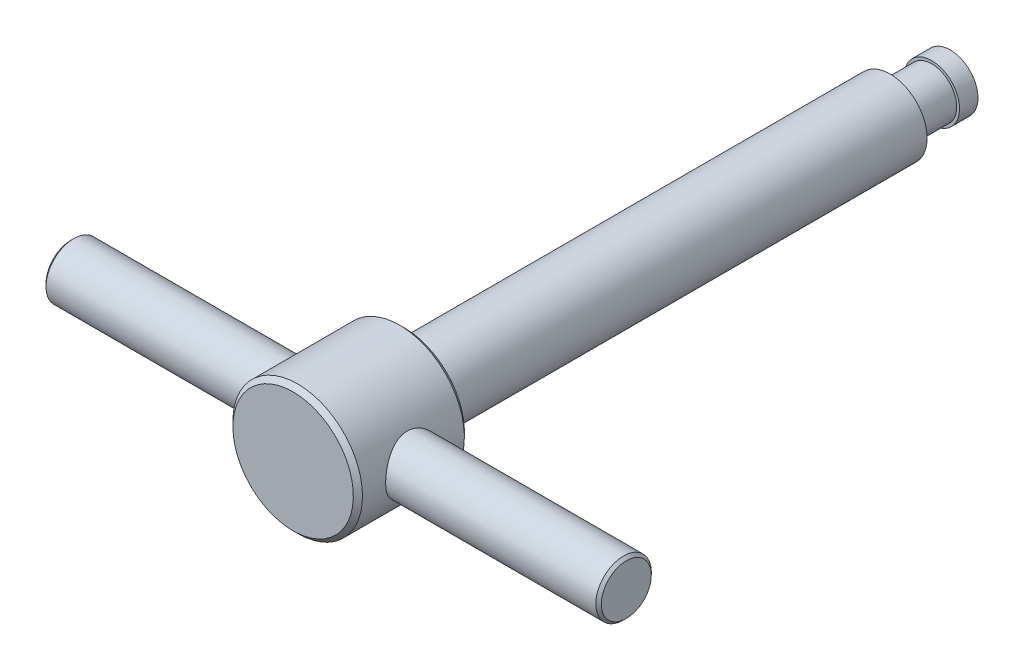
ISO-10303-21;
HEADER;
FILE_DESCRIPTION(('STEP AP214'),'2;1');
FILE_NAME('part.step','',(''),(''),'','','');
FILE_SCHEMA(('AUTOMOTIVE_DESIGN { 1 0 10303 214 1 1 1 1 }'));
ENDSEC;
DATA;
#1=APPLICATION_CONTEXT('core data for automotive mechanical design processes');
#2=APPLICATION_PROTOCOL_DEFINITION('international standard','automotive_design',2000,#1);
#3=PRODUCT_CONTEXT('',#1,'mechanical');
#4=PRODUCT('Part','Part','',(#3));
#5=PRODUCT_RELATED_PRODUCT_CATEGORY('part','',(#4));
#6=PRODUCT_DEFINITION_FORMATION('','',#4);
#7=PRODUCT_DEFINITION_CONTEXT('part definition',#1,'design');
#8=PRODUCT_DEFINITION('design','',#6,#7);
#9=PRODUCT_DEFINITION_SHAPE('','',#8);
#10=(LENGTH_UNIT() NAMED_UNIT(*) SI_UNIT(.MILLI.,.METRE.));
#11=(NAMED_UNIT(*) PLANE_ANGLE_UNIT() SI_UNIT($,.RADIAN.));
#12=(NAMED_UNIT(*) SI_UNIT($,.STERADIAN.) SOLID_ANGLE_UNIT());
#13=UNCERTAINTY_MEASURE_WITH_UNIT(LENGTH_MEASURE(1.E-05),#10,'distance_accuracy_value','');
#14=(GEOMETRIC_REPRESENTATION_CONTEXT(3) GLOBAL_UNCERTAINTY_ASSIGNED_CONTEXT((#13)) GLOBAL_UNIT_ASSIGNED_CONTEXT((#10,
#11,#12)) REPRESENTATION_CONTEXT('',''));
#15=CARTESIAN_POINT('',(0.,0.,0.));
#16=DIRECTION('',(0.,0.,1.));
#17=DIRECTION('',(1.,0.,0.));
#18=AXIS2_PLACEMENT_3D('',#15,#16,#17);
#19=CARTESIAN_POINT('',(30.,0.,68.7));
#20=DIRECTION('',(-1.,0.,0.));
#21=DIRECTION('',(0.,-1.,0.));
#22=AXIS2_PLACEMENT_3D('',#19,#20,#21);
#23=PLANE('',#22);
#24=CARTESIAN_POINT('',(29.9999999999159,0.,66.));
#25=DIRECTION('',(-1.,0.,0.));
#26=DIRECTION('',(0.,-1.,0.));
#27=AXIS2_PLACEMENT_3D('',#24,#25,#26);
#28=CIRCLE('',#27,2.70000000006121);
#29=CARTESIAN_POINT('',(29.9999999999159,-2.70000000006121,66.));
#30=VERTEX_POINT('',#29);
#31=EDGE_CURVE('E15',#30,#30,#28,.T.);
#32=ORIENTED_EDGE('',*,*,#31,.F.);
#33=EDGE_LOOP('',(#32));
#34=FACE_BOUND('',#33,.T.);
#35=ADVANCED_FACE('F12',(#34),#23,.F.);
#36=CARTESIAN_POINT('',(-30.,0.,66.));
#37=DIRECTION('',(1.,0.,0.));
#38=DIRECTION('',(0.,1.,0.));
#39=AXIS2_PLACEMENT_3D('',#36,#37,#38);
#40=PLANE('',#39);
#41=CARTESIAN_POINT('',(-29.9999999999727,0.,66.));
#42=DIRECTION('',(1.,0.,0.));
#43=DIRECTION('',(0.,1.,0.));
#44=AXIS2_PLACEMENT_3D('',#41,#42,#43);
#45=CIRCLE('',#44,2.70000000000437);
#46=CARTESIAN_POINT('',(-29.9999999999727,2.70000000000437,66.));
#47=VERTEX_POINT('',#46);
#48=EDGE_CURVE('E133',#47,#47,#45,.T.);
#49=ORIENTED_EDGE('',*,*,#48,.F.);
#50=EDGE_LOOP('',(#49));
#51=FACE_BOUND('',#50,.T.);
#52=ADVANCED_FACE('F171',(#51),#40,.F.);
#53=CARTESIAN_POINT('',(0.,0.,5.));
#54=DIRECTION('',(-1.,0.,0.));
#55=DIRECTION('',(0.,1.,0.));
#56=AXIS2_PLACEMENT_3D('',#53,#54,#55);
#57=SPHERICAL_SURFACE('',#56,5.);
#58=CARTESIAN_POINT('',(0.,0.,1.));
#59=DIRECTION('',(0.,0.,1.));
#60=DIRECTION('',(0.,-1.,0.));
#61=AXIS2_PLACEMENT_3D('',#58,#59,#60);
#62=CIRCLE('',#61,3.);
#63=CARTESIAN_POINT('',(0.,-3.,1.));
#64=VERTEX_POINT('',#63);
#65=EDGE_CURVE('E126',#64,#64,#62,.T.);
#66=ORIENTED_EDGE('',*,*,#65,.F.);
#67=EDGE_LOOP('',(#66));
#68=FACE_BOUND('',#67,.T.);
#69=ADVANCED_FACE('F168',(#68),#57,.T.);
#70=CARTESIAN_POINT('',(29.700000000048,0.,66.));
#71=DIRECTION('',(-1.,0.,0.));
#72=DIRECTION('',(0.,-1.,0.));
#73=AXIS2_PLACEMENT_3D('',#70,#71,#72);
#74=CONICAL_SURFACE('',#73,2.99999999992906,0.785398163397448);
#75=CARTESIAN_POINT('',(29.7,0.,66.));
#76=DIRECTION('',(-1.,0.,0.));
#77=DIRECTION('',(0.,-1.,0.));
#78=AXIS2_PLACEMENT_3D('',#75,#76,#77);
#79=CIRCLE('',#78,3.);
#80=CARTESIAN_POINT('',(29.7,-3.,66.));
#81=VERTEX_POINT('',#80);
#82=EDGE_CURVE('E124',#81,#81,#79,.T.);
#83=ORIENTED_EDGE('',*,*,#82,.F.);
#84=EDGE_LOOP('',(#83));
#85=FACE_BOUND('',#84,.T.);
#86=ORIENTED_EDGE('',*,*,#31,.T.);
#87=EDGE_LOOP('',(#86));
#88=FACE_BOUND('',#87,.T.);
#89=ADVANCED_FACE('F164',(#85,#88),#74,.T.);
#90=CARTESIAN_POINT('',(0.,0.,72.));
#91=DIRECTION('',(0.,0.,-1.));
#92=DIRECTION('',(0.,1.,0.));
#93=AXIS2_PLACEMENT_3D('',#90,#91,#92);
#94=PLANE('',#93);
#95=CARTESIAN_POINT('',(0.,0.,71.9999999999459));
#96=DIRECTION('',(0.,0.,-1.));
#97=DIRECTION('',(0.,1.,0.));
#98=AXIS2_PLACEMENT_3D('',#95,#96,#97);
#99=CIRCLE('',#98,6.50502525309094);
#100=CARTESIAN_POINT('',(0.,6.50502525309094,71.9999999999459));
#101=VERTEX_POINT('',#100);
#102=EDGE_CURVE('E121',#101,#101,#99,.T.);
#103=ORIENTED_EDGE('',*,*,#102,.F.);
#104=EDGE_LOOP('',(#103));
#105=FACE_BOUND('',#104,.T.);
#106=ADVANCED_FACE('F160',(#105),#94,.F.);
#107=CARTESIAN_POINT('',(-29.6999999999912,0.,66.));
#108=DIRECTION('',(1.,0.,0.));
#109=DIRECTION('',(0.,1.,0.));
#110=AXIS2_PLACEMENT_3D('',#107,#108,#109);
#111=CONICAL_SURFACE('',#110,2.99999999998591,0.785398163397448);
#112=ORIENTED_EDGE('',*,*,#48,.T.);
#113=EDGE_LOOP('',(#112));
#114=FACE_BOUND('',#113,.T.);
#115=CARTESIAN_POINT('',(-29.7,0.,66.));
#116=DIRECTION('',(-1.,0.,0.));
#117=DIRECTION('',(0.,-1.,0.));
#118=AXIS2_PLACEMENT_3D('',#115,#116,#117);
#119=CIRCLE('',#118,3.);
#120=CARTESIAN_POINT('',(-29.7,-3.,66.));
#121=VERTEX_POINT('',#120);
#122=EDGE_CURVE('E117',#121,#121,#119,.F.);
#123=ORIENTED_EDGE('',*,*,#122,.F.);
#124=EDGE_LOOP('',(#123));
#125=FACE_BOUND('',#124,.T.);
#126=ADVANCED_FACE('F154',(#114,#125),#111,.T.);
#127=CARTESIAN_POINT('',(0.,0.,0.));
#128=DIRECTION('',(0.,0.,1.));
#129=DIRECTION('',(0.,-1.,0.));
#130=AXIS2_PLACEMENT_3D('',#127,#128,#129);
#131=CYLINDRICAL_SURFACE('',#130,3.);
#132=CARTESIAN_POINT('',(0.,0.,3.));
#133=DIRECTION('',(0.,0.,1.));
#134=DIRECTION('',(0.,-1.,0.));
#135=AXIS2_PLACEMENT_3D('',#132,#133,#134);
#136=CIRCLE('',#135,3.);
#137=CARTESIAN_POINT('',(0.,-3.,3.));
#138=VERTEX_POINT('',#137);
#139=EDGE_CURVE('E120',#138,#138,#136,.F.);
#140=ORIENTED_EDGE('',*,*,#139,.T.);
#141=EDGE_LOOP('',(#140));
#142=FACE_BOUND('',#141,.T.);
#143=ORIENTED_EDGE('',*,*,#65,.T.);
#144=EDGE_LOOP('',(#143));
#145=FACE_BOUND('',#144,.T.);
#146=ADVANCED_FACE('F147',(#142,#145),#131,.T.);
#147=CARTESIAN_POINT('',(30.,0.,66.));
#148=DIRECTION('',(-1.,0.,0.));
#149=DIRECTION('',(0.,-1.,0.));
#150=AXIS2_PLACEMENT_3D('',#147,#148,#149);
#151=CYLINDRICAL_SURFACE('',#150,3.);
#152=CARTESIAN_POINT('',(6.32634555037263,2.99622295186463,65.8495073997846));
#153=CARTESIAN_POINT('',(6.32826447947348,2.99217213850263,65.7688757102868));
#154=CARTESIAN_POINT('',(6.33172535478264,2.98486151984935,65.6884118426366));
#155=CARTESIAN_POINT('',(6.34160222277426,2.96381632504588,65.5284968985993));
#156=CARTESIAN_POINT('',(6.34802020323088,2.95007742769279,65.4490465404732));
#157=CARTESIAN_POINT('',(6.3714403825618,2.89934380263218,65.2127740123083));
#158=CARTESIAN_POINT('',(6.39260177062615,2.85284537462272,65.0582841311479));
#159=CARTESIAN_POINT('',(6.44315888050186,2.73672071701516,64.7607182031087));
#160=CARTESIAN_POINT('',(6.47251695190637,2.66719997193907,64.6175937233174));
#161=CARTESIAN_POINT('',(6.53618130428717,2.50713763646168,64.3449352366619));
#162=CARTESIAN_POINT('',(6.57048627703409,2.41660159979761,64.2153976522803));
#163=CARTESIAN_POINT('',(6.64282052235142,2.21033740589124,63.964715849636));
#164=CARTESIAN_POINT('',(6.68094850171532,2.09338697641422,63.844604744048));
#165=CARTESIAN_POINT('',(6.75493795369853,1.84068917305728,63.6251585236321));
#166=CARTESIAN_POINT('',(6.79079872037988,1.70493598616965,63.5258298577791));
#167=CARTESIAN_POINT('',(6.85745262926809,1.41359734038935,63.3482779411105));
#168=CARTESIAN_POINT('',(6.88807643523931,1.25756417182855,63.270720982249));
#169=CARTESIAN_POINT('',(6.93948106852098,0.933018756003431,63.1434624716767));
#170=CARTESIAN_POINT('',(6.96026753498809,0.764513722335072,63.0937449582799));
#171=CARTESIAN_POINT('',(6.98854168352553,0.431666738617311,63.0266901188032));
#172=CARTESIAN_POINT('',(6.99681179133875,0.267775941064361,63.0074438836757));
#173=CARTESIAN_POINT('',(7.001662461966,-0.061091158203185,62.996117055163));
#174=CARTESIAN_POINT('',(6.9982467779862,-0.226067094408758,63.0040277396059));
#175=CARTESIAN_POINT('',(6.98061410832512,-0.543036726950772,63.0454634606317));
#176=CARTESIAN_POINT('',(6.966989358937,-0.695250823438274,63.0775846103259));
#177=CARTESIAN_POINT('',(6.93097400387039,-0.991940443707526,63.164517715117));
#178=CARTESIAN_POINT('',(6.90858231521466,-1.13641500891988,63.2193324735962));
#179=CARTESIAN_POINT('',(6.85631790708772,-1.41849030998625,63.3518112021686));
#180=CARTESIAN_POINT('',(6.8262389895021,-1.5557499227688,63.4301174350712));
#181=CARTESIAN_POINT('',(6.76175360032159,-1.81566779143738,63.6066635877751));
#182=CARTESIAN_POINT('',(6.72734530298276,-1.93831984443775,63.7049119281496));
#183=CARTESIAN_POINT('',(6.65467138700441,-2.17528088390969,63.9272021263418));
#184=CARTESIAN_POINT('',(6.61631054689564,-2.28826342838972,64.052630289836));
#185=CARTESIAN_POINT('',(6.54230506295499,-2.49199129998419,64.3211920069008));
#186=CARTESIAN_POINT('',(6.50666120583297,-2.58273020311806,64.4643306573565));
#187=CARTESIAN_POINT('',(6.44169002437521,-2.74082163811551,64.7680339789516));
#188=CARTESIAN_POINT('',(6.4124965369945,-2.80769373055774,64.9288795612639));
#189=CARTESIAN_POINT('',(6.36544592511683,-2.91281204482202,65.2611995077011));
#190=CARTESIAN_POINT('',(6.34757878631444,-2.95108355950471,65.4326643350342));
#191=CARTESIAN_POINT('',(6.32684241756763,-2.99526422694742,65.7666222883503));
#192=CARTESIAN_POINT('',(6.32289024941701,-3.00351193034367,65.9287396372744));
#193=CARTESIAN_POINT('',(6.32751135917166,-2.99376571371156,66.2519835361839));
#194=CARTESIAN_POINT('',(6.33608227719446,-2.97577673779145,66.4131102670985));
#195=CARTESIAN_POINT('',(6.36375836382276,-2.91608676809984,66.7209155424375));
#196=CARTESIAN_POINT('',(6.3822785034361,-2.87569894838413,66.8679066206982));
#197=CARTESIAN_POINT('',(6.42725603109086,-2.77371031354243,67.1530275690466));
#198=CARTESIAN_POINT('',(6.45371556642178,-2.71210375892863,67.2911550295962));
#199=CARTESIAN_POINT('',(6.51358659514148,-2.56512033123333,67.5638388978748));
#200=CARTESIAN_POINT('',(6.54732342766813,-2.47852390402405,67.6976650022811));
#201=CARTESIAN_POINT('',(6.61712783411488,-2.28563635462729,67.9496322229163));
#202=CARTESIAN_POINT('',(6.65319650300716,-2.17933593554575,68.0677658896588));
#203=CARTESIAN_POINT('',(6.72705004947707,-1.94001961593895,68.2946952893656));
#204=CARTESIAN_POINT('',(6.76474236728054,-1.80554916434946,68.4019947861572));
#205=CARTESIAN_POINT('',(6.83473227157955,-1.51925001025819,68.5925733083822));
#206=CARTESIAN_POINT('',(6.86703025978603,-1.36742260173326,68.6758541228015));
#207=CARTESIAN_POINT('',(6.9222349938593,-1.05252985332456,68.8144861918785));
#208=CARTESIAN_POINT('',(6.94526981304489,-0.88965696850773,68.870220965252));
#209=CARTESIAN_POINT('',(6.97992599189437,-0.555653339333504,68.9531009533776));
#210=CARTESIAN_POINT('',(6.99155445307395,-0.384527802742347,68.9802639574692));
#211=CARTESIAN_POINT('',(7.00161796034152,-0.0528390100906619,69.0037879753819));
#212=CARTESIAN_POINT('',(7.00098365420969,0.107545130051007,69.0023216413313));
#213=CARTESIAN_POINT('',(6.98886077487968,0.425608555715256,68.9739436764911));
#214=CARTESIAN_POINT('',(6.97737328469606,0.583288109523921,68.9470345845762));
#215=CARTESIAN_POINT('',(6.94513836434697,0.887657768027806,68.8698659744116));
#216=CARTESIAN_POINT('',(6.92462231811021,1.03452166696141,68.8201887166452));
#217=CARTESIAN_POINT('',(6.87632878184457,1.317870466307,68.6994354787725));
#218=CARTESIAN_POINT('',(6.84854960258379,1.45435294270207,68.6283545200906));
#219=CARTESIAN_POINT('',(6.78647151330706,1.72153399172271,68.4622072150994));
#220=CARTESIAN_POINT('',(6.75189125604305,1.85145959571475,68.3660047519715));
#221=CARTESIAN_POINT('',(6.68066929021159,2.09395764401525,68.1543583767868));
#222=CARTESIAN_POINT('',(6.64402670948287,2.20652267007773,68.0389062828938));
#223=CARTESIAN_POINT('',(6.56984841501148,2.41879434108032,67.7829464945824));
#224=CARTESIAN_POINT('',(6.53241556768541,2.51714659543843,67.6412826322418));
#225=CARTESIAN_POINT('',(6.46370144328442,2.68870997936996,67.341846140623));
#226=CARTESIAN_POINT('',(6.43242233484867,2.76191225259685,67.184067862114));
#227=CARTESIAN_POINT('',(6.39360961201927,2.85004205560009,66.9404988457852));
#228=CARTESIAN_POINT('',(6.38210422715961,2.87564429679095,66.8590623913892));
#229=CARTESIAN_POINT('',(6.36199032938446,2.91987586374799,66.6939817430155));
#230=CARTESIAN_POINT('',(6.35338035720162,2.9385087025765,66.6103386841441));
#231=CARTESIAN_POINT('',(6.33940677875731,2.9685341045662,66.4417284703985));
#232=CARTESIAN_POINT('',(6.33403480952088,2.97994532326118,66.3567653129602));
#233=CARTESIAN_POINT('',(6.32671830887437,2.99544842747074,66.1860694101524));
#234=CARTESIAN_POINT('',(6.32477116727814,2.99954588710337,66.1003373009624));
#235=CARTESIAN_POINT('',(6.32450831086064,3.00009880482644,65.9870854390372));
#236=CARTESIAN_POINT('',(6.32462478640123,2.99985362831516,65.9595527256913));
#237=CARTESIAN_POINT('',(6.32521628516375,2.99860624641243,65.9045093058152));
#238=CARTESIAN_POINT('',(6.32569129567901,2.99760406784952,65.8769985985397));
#239=CARTESIAN_POINT('',(6.32634555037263,2.99622295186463,65.8495073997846));
#240=B_SPLINE_CURVE_WITH_KNOTS('',3,(#152,#153,#154,#155,#156,#157,#158,#159,#160,#161,#162,
#163,#164,#165,#166,#167,#168,#169,#170,#171,#172,#173,#174,#175,#176,#177,#178,#179,#180,#181,
#182,#183,#184,#185,#186,#187,#188,#189,#190,#191,#192,#193,#194,#195,#196,#197,#198,#199,#200,
#201,#202,#203,#204,#205,#206,#207,#208,#209,#210,#211,#212,#213,#214,#215,#216,#217,#218,#219,
#220,#221,#222,#223,#224,#225,#226,#227,#228,#229,#230,#231,#232,#233,#234,#235,#236,#237,#238,
#239),.UNSPECIFIED.,.T.,.F.,(4,2,2,2,2,2,2,2,2,2,2,2,2,2,2,2,2,2,2,2,2,2,2,2,2,2,2,2,2,2,2,2,2,
2,2,2,2,2,2,2,2,2,2,4),(0.,0.242237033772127,0.484637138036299,0.970189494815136,
1.45354721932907,1.9367773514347,2.45025889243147,2.96389953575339,3.49187330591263,
4.0195440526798,4.51262569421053,5.00554898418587,5.47189828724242,5.93830521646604,
6.41885040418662,6.89959892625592,7.41659728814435,7.93374478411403,8.46078245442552,
8.98735348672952,9.47190919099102,9.95637359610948,10.4150497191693,10.8738500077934,
11.3606033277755,11.8475868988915,12.3734108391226,12.8991956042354,13.4174378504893,
13.9353572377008,14.4141361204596,14.8928672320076,15.3599854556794,15.8272124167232,
16.3210681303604,16.8151342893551,17.3420827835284,17.8692166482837,18.1273357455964,
18.3853245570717,18.6426441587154,18.899767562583,18.9823606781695,19.064950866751),.UNSPECIFIED.);
#241=CARTESIAN_POINT('',(6.32634555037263,2.99622295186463,65.8495073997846));
#242=VERTEX_POINT('',#241);
#243=EDGE_CURVE('E46',#242,#242,#240,.T.);
#244=ORIENTED_EDGE('',*,*,#243,.F.);
#245=EDGE_LOOP('',(#244));
#246=FACE_BOUND('',#245,.T.);
#247=ORIENTED_EDGE('',*,*,#82,.T.);
#248=EDGE_LOOP('',(#247));
#249=FACE_BOUND('',#248,.T.);
#250=ADVANCED_FACE('F145',(#246,#249),#151,.T.);
#251=CARTESIAN_POINT('',(0.,0.,71.5050252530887));
#252=DIRECTION('',(0.,0.,-1.));
#253=DIRECTION('',(0.,1.,0.));
#254=AXIS2_PLACEMENT_3D('',#251,#252,#253);
#255=CONICAL_SURFACE('',#254,6.99999999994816,0.785398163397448);
#256=ORIENTED_EDGE('',*,*,#102,.T.);
#257=EDGE_LOOP('',(#256));
#258=FACE_BOUND('',#257,.T.);
#259=CARTESIAN_POINT('',(0.,0.,71.5050252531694));
#260=DIRECTION('',(0.,0.,1.));
#261=DIRECTION('',(0.,-1.,0.));
#262=AXIS2_PLACEMENT_3D('',#259,#260,#261);
#263=CIRCLE('',#262,7.);
#264=CARTESIAN_POINT('',(0.,-7.,71.5050252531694));
#265=VERTEX_POINT('',#264);
#266=EDGE_CURVE('E45',#265,#265,#263,.F.);
#267=ORIENTED_EDGE('',*,*,#266,.F.);
#268=EDGE_LOOP('',(#267));
#269=FACE_BOUND('',#268,.T.);
#270=ADVANCED_FACE('F72',(#258,#269),#255,.T.);
#271=CARTESIAN_POINT('',(30.,0.,66.));
#272=DIRECTION('',(-1.,0.,0.));
#273=DIRECTION('',(0.,-1.,0.));
#274=AXIS2_PLACEMENT_3D('',#271,#272,#273);
#275=CYLINDRICAL_SURFACE('',#274,3.);
#276=ORIENTED_EDGE('',*,*,#122,.T.);
#277=EDGE_LOOP('',(#276));
#278=FACE_BOUND('',#277,.T.);
#279=CARTESIAN_POINT('',(-6.32634555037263,2.99622295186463,66.1504926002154));
#280=CARTESIAN_POINT('',(-6.32826447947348,2.99217213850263,66.2311242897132));
#281=CARTESIAN_POINT('',(-6.33172535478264,2.98486151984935,66.3115881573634));
#282=CARTESIAN_POINT('',(-6.34160222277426,2.96381632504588,66.4715031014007));
#283=CARTESIAN_POINT('',(-6.34802020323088,2.95007742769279,66.5509534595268));
#284=CARTESIAN_POINT('',(-6.3714403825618,2.89934380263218,66.7872259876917));
#285=CARTESIAN_POINT('',(-6.39260177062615,2.85284537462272,66.9417158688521));
#286=CARTESIAN_POINT('',(-6.44315888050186,2.73672071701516,67.2392817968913));
#287=CARTESIAN_POINT('',(-6.47251695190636,2.66719997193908,67.3824062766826));
#288=CARTESIAN_POINT('',(-6.53618130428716,2.5071376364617,67.6550647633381));
#289=CARTESIAN_POINT('',(-6.57048627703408,2.41660159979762,67.7846023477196));
#290=CARTESIAN_POINT('',(-6.64282052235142,2.21033740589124,68.035284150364));
#291=CARTESIAN_POINT('',(-6.68094850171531,2.09338697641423,68.155395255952));
#292=CARTESIAN_POINT('',(-6.75493795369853,1.84068917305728,68.3748414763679));
#293=CARTESIAN_POINT('',(-6.79079872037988,1.70493598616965,68.4741701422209));
#294=CARTESIAN_POINT('',(-6.85745262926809,1.41359734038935,68.6517220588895));
#295=CARTESIAN_POINT('',(-6.88807643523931,1.25756417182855,68.729279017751));
#296=CARTESIAN_POINT('',(-6.93948106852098,0.933018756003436,68.8565375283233));
#297=CARTESIAN_POINT('',(-6.96026753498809,0.764513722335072,68.9062550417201));
#298=CARTESIAN_POINT('',(-6.98854168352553,0.431666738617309,68.9733098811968));
#299=CARTESIAN_POINT('',(-6.99681179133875,0.26777594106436,68.9925561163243));
#300=CARTESIAN_POINT('',(-7.001662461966,-0.0610911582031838,69.003882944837));
#301=CARTESIAN_POINT('',(-6.9982467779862,-0.226067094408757,68.9959722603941));
#302=CARTESIAN_POINT('',(-6.98061410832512,-0.543036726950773,68.9545365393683));
#303=CARTESIAN_POINT('',(-6.966989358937,-0.695250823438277,68.9224153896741));
#304=CARTESIAN_POINT('',(-6.93097400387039,-0.991940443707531,68.8354822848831));
#305=CARTESIAN_POINT('',(-6.90858231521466,-1.13641500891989,68.7806675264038));
#306=CARTESIAN_POINT('',(-6.85631790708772,-1.41849030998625,68.6481887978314));
#307=CARTESIAN_POINT('',(-6.8262389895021,-1.5557499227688,68.5698825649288));
#308=CARTESIAN_POINT('',(-6.76175360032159,-1.81566779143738,68.393336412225));
#309=CARTESIAN_POINT('',(-6.72734530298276,-1.93831984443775,68.2950880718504));
#310=CARTESIAN_POINT('',(-6.65467138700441,-2.17528088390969,68.0727978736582));
#311=CARTESIAN_POINT('',(-6.61631054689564,-2.28826342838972,67.947369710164));
#312=CARTESIAN_POINT('',(-6.54230506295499,-2.49199129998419,67.6788079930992));
#313=CARTESIAN_POINT('',(-6.50666120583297,-2.58273020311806,67.5356693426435));
#314=CARTESIAN_POINT('',(-6.44169002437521,-2.74082163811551,67.2319660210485));
#315=CARTESIAN_POINT('',(-6.4124965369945,-2.80769373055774,67.0711204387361));
#316=CARTESIAN_POINT('',(-6.36544592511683,-2.91281204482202,66.7388004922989));
#317=CARTESIAN_POINT('',(-6.34757878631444,-2.95108355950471,66.5673356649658));
#318=CARTESIAN_POINT('',(-6.32684241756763,-2.99526422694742,66.2333777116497));
#319=CARTESIAN_POINT('',(-6.32289024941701,-3.00351193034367,66.0712603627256));
#320=CARTESIAN_POINT('',(-6.32751135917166,-2.99376571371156,65.7480164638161));
#321=CARTESIAN_POINT('',(-6.33608227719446,-2.97577673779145,65.5868897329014));
#322=CARTESIAN_POINT('',(-6.36375836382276,-2.91608676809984,65.2790844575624));
#323=CARTESIAN_POINT('',(-6.3822785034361,-2.87569894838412,65.1320933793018));
#324=CARTESIAN_POINT('',(-6.42725603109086,-2.77371031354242,64.8469724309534));
#325=CARTESIAN_POINT('',(-6.45371556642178,-2.71210375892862,64.7088449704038));
#326=CARTESIAN_POINT('',(-6.51358659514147,-2.56512033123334,64.4361611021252));
#327=CARTESIAN_POINT('',(-6.54732342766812,-2.47852390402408,64.3023349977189));
#328=CARTESIAN_POINT('',(-6.61712783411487,-2.28563635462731,64.0503677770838));
#329=CARTESIAN_POINT('',(-6.65319650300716,-2.17933593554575,63.9322341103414));
#330=CARTESIAN_POINT('',(-6.72705004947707,-1.94001961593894,63.7053047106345));
#331=CARTESIAN_POINT('',(-6.76474236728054,-1.80554916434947,63.5980052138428));
#332=CARTESIAN_POINT('',(-6.83473227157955,-1.51925001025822,63.4074266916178));
#333=CARTESIAN_POINT('',(-6.86703025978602,-1.36742260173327,63.3241458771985));
#334=CARTESIAN_POINT('',(-6.9222349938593,-1.05252985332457,63.1855138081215));
#335=CARTESIAN_POINT('',(-6.94526981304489,-0.889656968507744,63.129779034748));
#336=CARTESIAN_POINT('',(-6.97992599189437,-0.555653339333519,63.0468990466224));
#337=CARTESIAN_POINT('',(-6.99155445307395,-0.384527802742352,63.0197360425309));
#338=CARTESIAN_POINT('',(-7.00161796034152,-0.0528390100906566,62.9962120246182));
#339=CARTESIAN_POINT('',(-7.00098365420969,0.107545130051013,62.9976783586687));
#340=CARTESIAN_POINT('',(-6.98886077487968,0.425608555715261,63.0260563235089));
#341=CARTESIAN_POINT('',(-6.97737328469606,0.583288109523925,63.0529654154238));
#342=CARTESIAN_POINT('',(-6.94513836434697,0.887657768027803,63.1301340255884));
#343=CARTESIAN_POINT('',(-6.92462231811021,1.0345216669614,63.1798112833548));
#344=CARTESIAN_POINT('',(-6.87632878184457,1.31787046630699,63.3005645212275));
#345=CARTESIAN_POINT('',(-6.84854960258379,1.45435294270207,63.3716454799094));
#346=CARTESIAN_POINT('',(-6.78647151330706,1.72153399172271,63.5377927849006));
#347=CARTESIAN_POINT('',(-6.75189125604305,1.85145959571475,63.6339952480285));
#348=CARTESIAN_POINT('',(-6.68066929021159,2.09395764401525,63.8456416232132));
#349=CARTESIAN_POINT('',(-6.64402670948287,2.20652267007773,63.9610937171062));
#350=CARTESIAN_POINT('',(-6.56984841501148,2.41879434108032,64.2170535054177));
#351=CARTESIAN_POINT('',(-6.53241556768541,2.51714659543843,64.3587173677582));
#352=CARTESIAN_POINT('',(-6.46370144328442,2.68870997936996,64.658153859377));
#353=CARTESIAN_POINT('',(-6.43242233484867,2.76191225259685,64.815932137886));
#354=CARTESIAN_POINT('',(-6.39360961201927,2.85004205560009,65.0595011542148));
#355=CARTESIAN_POINT('',(-6.38210422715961,2.87564429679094,65.1409376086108));
#356=CARTESIAN_POINT('',(-6.36199032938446,2.91987586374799,65.3060182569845));
#357=CARTESIAN_POINT('',(-6.35338035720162,2.93850870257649,65.3896613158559));
#358=CARTESIAN_POINT('',(-6.33940677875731,2.9685341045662,65.5582715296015));
#359=CARTESIAN_POINT('',(-6.33403480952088,2.97994532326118,65.6432346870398));
#360=CARTESIAN_POINT('',(-6.32671830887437,2.99544842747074,65.8139305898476));
#361=CARTESIAN_POINT('',(-6.32477116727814,2.99954588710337,65.8996626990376));
#362=CARTESIAN_POINT('',(-6.32450831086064,3.00009880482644,66.0129145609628));
#363=CARTESIAN_POINT('',(-6.32462478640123,2.99985362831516,66.0404472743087));
#364=CARTESIAN_POINT('',(-6.32521628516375,2.99860624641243,66.0954906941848));
#365=CARTESIAN_POINT('',(-6.32569129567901,2.99760406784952,66.1230014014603));
#366=CARTESIAN_POINT('',(-6.32634555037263,2.99622295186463,66.1504926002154));
#367=B_SPLINE_CURVE_WITH_KNOTS('',3,(#279,#280,#281,#282,#283,#284,#285,#286,#287,#288,#289,
#290,#291,#292,#293,#294,#295,#296,#297,#298,#299,#300,#301,#302,#303,#304,#305,#306,#307,#308,
#309,#310,#311,#312,#313,#314,#315,#316,#317,#318,#319,#320,#321,#322,#323,#324,#325,#326,#327,
#328,#329,#330,#331,#332,#333,#334,#335,#336,#337,#338,#339,#340,#341,#342,#343,#344,#345,#346,
#347,#348,#349,#350,#351,#352,#353,#354,#355,#356,#357,#358,#359,#360,#361,#362,#363,#364,#365,
#366),.UNSPECIFIED.,.T.,.F.,(4,2,2,2,2,2,2,2,2,2,2,2,2,2,2,2,2,2,2,2,2,2,2,2,2,2,2,2,2,2,2,2,2,
2,2,2,2,2,2,2,2,2,2,4),(0.,0.242237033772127,0.484637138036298,0.970189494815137,
1.45354721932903,1.93677735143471,2.45025889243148,2.96389953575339,3.49187330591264,
4.01954405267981,4.51262569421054,5.00554898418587,5.47189828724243,5.93830521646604,
6.41885040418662,6.89959892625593,7.41659728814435,7.93374478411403,8.46078245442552,
8.98735348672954,9.47190919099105,9.9563735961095,10.4150497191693,10.8738500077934,
11.3606033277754,11.8475868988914,12.3734108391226,12.8991956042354,13.4174378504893,
13.9353572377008,14.4141361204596,14.8928672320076,15.3599854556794,15.8272124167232,
16.3210681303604,16.8151342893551,17.3420827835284,17.8692166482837,18.1273357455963,
18.3853245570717,18.6426441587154,18.8997675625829,18.9823606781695,19.064950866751),.UNSPECIFIED.);
#368=CARTESIAN_POINT('',(-6.32634555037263,2.99622295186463,66.1504926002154));
#369=VERTEX_POINT('',#368);
#370=EDGE_CURVE('E37',#369,#369,#367,.T.);
#371=ORIENTED_EDGE('',*,*,#370,.F.);
#372=EDGE_LOOP('',(#371));
#373=FACE_BOUND('',#372,.T.);
#374=ADVANCED_FACE('F52',(#278,#373),#275,.T.);
#375=CARTESIAN_POINT('',(2.7,0.,3.));
#376=DIRECTION('',(0.,0.,-1.));
#377=DIRECTION('',(0.,1.,0.));
#378=AXIS2_PLACEMENT_3D('',#375,#376,#377);
#379=PLANE('',#378);
#380=CARTESIAN_POINT('',(0.,0.,3.));
#381=DIRECTION('',(0.,0.,1.));
#382=DIRECTION('',(0.,-1.,0.));
#383=AXIS2_PLACEMENT_3D('',#380,#381,#382);
#384=CIRCLE('',#383,2.7);
#385=CARTESIAN_POINT('',(0.,-2.7,3.));
#386=VERTEX_POINT('',#385);
#387=EDGE_CURVE('E33',#386,#386,#384,.T.);
#388=ORIENTED_EDGE('',*,*,#387,.F.);
#389=EDGE_LOOP('',(#388));
#390=FACE_BOUND('',#389,.T.);
#391=ORIENTED_EDGE('',*,*,#139,.F.);
#392=EDGE_LOOP('',(#391));
#393=FACE_BOUND('',#392,.T.);
#394=ADVANCED_FACE('F61',(#390,#393),#379,.F.);
#395=CARTESIAN_POINT('',(0.,0.,0.));
#396=DIRECTION('',(0.,0.,1.));
#397=DIRECTION('',(0.,-1.,0.));
#398=AXIS2_PLACEMENT_3D('',#395,#396,#397);
#399=CYLINDRICAL_SURFACE('',#398,7.);
#400=ORIENTED_EDGE('',*,*,#370,.T.);
#401=EDGE_LOOP('',(#400));
#402=FACE_BOUND('',#401,.T.);
#403=ORIENTED_EDGE('',*,*,#266,.T.);
#404=EDGE_LOOP('',(#403));
#405=FACE_BOUND('',#404,.T.);
#406=ORIENTED_EDGE('',*,*,#243,.T.);
#407=EDGE_LOOP('',(#406));
#408=FACE_BOUND('',#407,.T.);
#409=CARTESIAN_POINT('',(0.,0.,60.4949747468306));
#410=DIRECTION('',(0.,0.,1.));
#411=DIRECTION('',(0.,-1.,0.));
#412=AXIS2_PLACEMENT_3D('',#409,#410,#411);
#413=CIRCLE('',#412,7.);
#414=CARTESIAN_POINT('',(0.,-7.,60.4949747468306));
#415=VERTEX_POINT('',#414);
#416=EDGE_CURVE('E36',#415,#415,#413,.F.);
#417=ORIENTED_EDGE('',*,*,#416,.F.);
#418=EDGE_LOOP('',(#417));
#419=FACE_BOUND('',#418,.T.);
#420=ADVANCED_FACE('F56',(#402,#405,#408,#419),#399,.T.);
#421=CARTESIAN_POINT('',(0.,0.,0.));
#422=DIRECTION('',(0.,0.,1.));
#423=DIRECTION('',(0.,-1.,0.));
#424=AXIS2_PLACEMENT_3D('',#421,#422,#423);
#425=CYLINDRICAL_SURFACE('',#424,2.7);
#426=CARTESIAN_POINT('',(0.,0.,6.74944465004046));
#427=DIRECTION('',(0.,0.,1.));
#428=DIRECTION('',(0.,-1.,0.));
#429=AXIS2_PLACEMENT_3D('',#426,#427,#428);
#430=CIRCLE('',#429,2.69999999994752);
#431=CARTESIAN_POINT('',(0.,-2.69999999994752,6.74944465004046));
#432=VERTEX_POINT('',#431);
#433=EDGE_CURVE('E32',#432,#432,#430,.T.);
#434=ORIENTED_EDGE('',*,*,#433,.F.);
#435=EDGE_LOOP('',(#434));
#436=FACE_BOUND('',#435,.T.);
#437=ORIENTED_EDGE('',*,*,#387,.T.);
#438=EDGE_LOOP('',(#437));
#439=FACE_BOUND('',#438,.T.);
#440=ADVANCED_FACE('F60',(#436,#439),#425,.T.);
#441=CARTESIAN_POINT('',(0.,0.,60.4949747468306));
#442=DIRECTION('',(0.,0.,1.));
#443=DIRECTION('',(-1.,0.,0.));
#444=AXIS2_PLACEMENT_3D('',#441,#442,#443);
#445=CONICAL_SURFACE('',#444,7.,0.785398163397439);
#446=ORIENTED_EDGE('',*,*,#416,.T.);
#447=EDGE_LOOP('',(#446));
#448=FACE_BOUND('',#447,.T.);
#449=CARTESIAN_POINT('',(0.,0.,60.));
#450=DIRECTION('',(0.,0.,1.));
#451=DIRECTION('',(-1.,0.,0.));
#452=AXIS2_PLACEMENT_3D('',#449,#450,#451);
#453=CIRCLE('',#452,6.50502525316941);
#454=CARTESIAN_POINT('',(-6.50502525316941,0.,60.));
#455=VERTEX_POINT('',#454);
#456=EDGE_CURVE('E24',#455,#455,#453,.T.);
#457=ORIENTED_EDGE('',*,*,#456,.T.);
#458=EDGE_LOOP('',(#457));
#459=FACE_BOUND('',#458,.T.);
#460=ADVANCED_FACE('F90',(#448,#459),#445,.T.);
#461=CARTESIAN_POINT('',(0.,0.,7.49999999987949));
#462=DIRECTION('',(0.,0.,1.));
#463=DIRECTION('',(-1.,0.,0.));
#464=AXIS2_PLACEMENT_3D('',#461,#462,#463);
#465=CONICAL_SURFACE('',#464,3.99999999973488,1.04719755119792);
#466=CARTESIAN_POINT('',(0.,0.,7.5));
#467=DIRECTION('',(0.,0.,1.));
#468=DIRECTION('',(0.,-1.,0.));
#469=AXIS2_PLACEMENT_3D('',#466,#467,#468);
#470=CIRCLE('',#469,4.);
#471=CARTESIAN_POINT('',(0.,-4.,7.5));
#472=VERTEX_POINT('',#471);
#473=EDGE_CURVE('E19',#472,#472,#470,.T.);
#474=ORIENTED_EDGE('',*,*,#473,.F.);
#475=EDGE_LOOP('',(#474));
#476=FACE_BOUND('',#475,.T.);
#477=ORIENTED_EDGE('',*,*,#433,.T.);
#478=EDGE_LOOP('',(#477));
#479=FACE_BOUND('',#478,.T.);
#480=ADVANCED_FACE('F84',(#476,#479),#465,.T.);
#481=CARTESIAN_POINT('',(6.50502525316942,0.,60.));
#482=DIRECTION('',(0.,0.,1.));
#483=DIRECTION('',(0.,-1.,0.));
#484=AXIS2_PLACEMENT_3D('',#481,#482,#483);
#485=PLANE('',#484);
#486=ORIENTED_EDGE('',*,*,#456,.F.);
#487=EDGE_LOOP('',(#486));
#488=FACE_BOUND('',#487,.T.);
#489=CARTESIAN_POINT('',(0.,0.,60.));
#490=DIRECTION('',(0.,0.,1.));
#491=DIRECTION('',(0.,-1.,0.));
#492=AXIS2_PLACEMENT_3D('',#489,#490,#491);
#493=CIRCLE('',#492,4.);
#494=CARTESIAN_POINT('',(0.,-4.,60.));
#495=VERTEX_POINT('',#494);
#496=EDGE_CURVE('E8',#495,#495,#493,.F.);
#497=ORIENTED_EDGE('',*,*,#496,.F.);
#498=EDGE_LOOP('',(#497));
#499=FACE_BOUND('',#498,.T.);
#500=ADVANCED_FACE('F78',(#488,#499),#485,.F.);
#501=CARTESIAN_POINT('',(0.,0.,0.));
#502=DIRECTION('',(0.,0.,1.));
#503=DIRECTION('',(0.,-1.,0.));
#504=AXIS2_PLACEMENT_3D('',#501,#502,#503);
#505=CYLINDRICAL_SURFACE('',#504,4.);
#506=ORIENTED_EDGE('',*,*,#496,.T.);
#507=EDGE_LOOP('',(#506));
#508=FACE_BOUND('',#507,.T.);
#509=ORIENTED_EDGE('',*,*,#473,.T.);
#510=EDGE_LOOP('',(#509));
#511=FACE_BOUND('',#510,.T.);
#512=ADVANCED_FACE('F76',(#508,#511),#505,.T.);
#513=CLOSED_SHELL('',(#35,#52,#69,#89,#106,#126,#146,#250,#270,#374,#394,#420,#440,#460,#480,
#500,#512));
#514=MANIFOLD_SOLID_BREP('B1',#513);
#515=ADVANCED_BREP_SHAPE_REPRESENTATION('',(#18,#514),#14);
#516=SHAPE_DEFINITION_REPRESENTATION(#9,#515);
ENDSEC;
END-ISO-10303-21;
